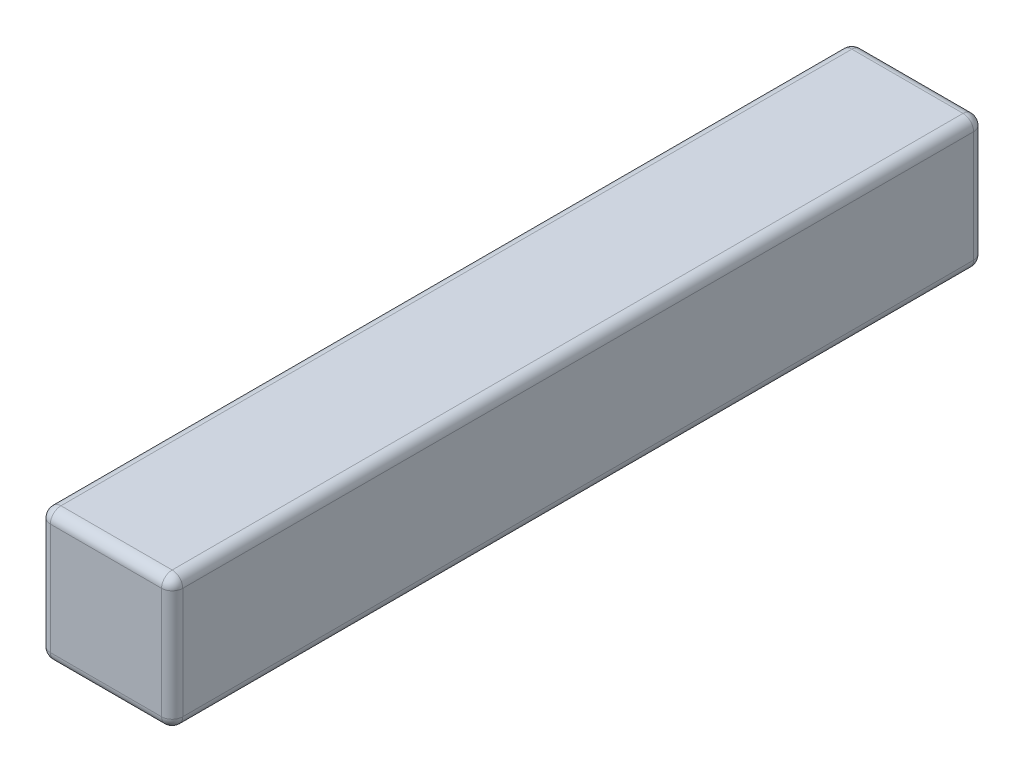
from build123d import *

# Parameters (mm, degrees)
SKETCH1_W           = 37.5
SKETCH1_H           = 37.5
BOSS_EXTRUDE1_DEPTH = 115
FILLET1_R           = 3


with BuildPart() as part:
    # Sketch1 → Boss-Extrude1 (new, symmetric)
    with BuildSketch(Plane.XY):
        Rectangle(SKETCH1_W, SKETCH1_H)
    extrude(amount=BOSS_EXTRUDE1_DEPTH, both=True)

    # Fillet1
    fillet1_edges = [part.edges().sort_by_distance(p)[0] for p in [
        (-18.75, 0, 115),
        (0, -18.75, 115),
        (18.75, 0, 115),
        (0, -18.75, -115),
        (-18.75, 0, -115),
        (0, 18.75, -115),
        (18.75, 0, -115),
        (18.75, -18.75, 0),
        (-18.75, -18.75, 0),
        (-18.75, 18.75, 0),
        (18.75, 18.75, 0),
        (0, 18.75, 115),
    ]]
    fillet(fillet1_edges, radius=FILLET1_R)


solid = part.part
